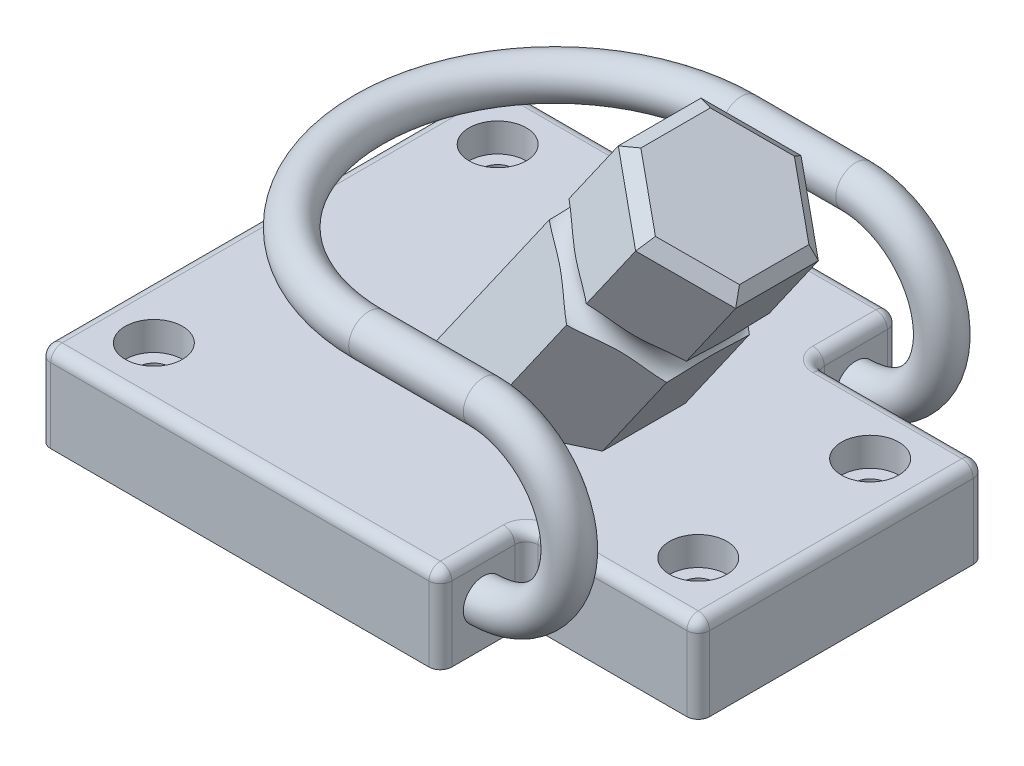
from build123d import *

# Parameters (mm, degrees)
BOSS_EXTRUDE1_DEPTH            = 15
BOSS_EXTRUDE3_DEPTH            = 60
SKETCH6_R                      = 3
CHAMFER1_SIZE                  = 2
SKETCH10_R                     = 3.5
REVOLVE1_ANGLE                 = 180
SKETCH12_R                     = 3.5
BOSS_EXTRUDE4_DEPTH            = 20
SKETCH13_R                     = 3.5
REVOLVE2_ANGLE                 = 180
FILLET2_R                      = 2
FILLET3_R                      = 2
CBORE_FOR_M5_SHCS1_D           = 5.5
CBORE_FOR_M5_SHCS1_CBORE_D     = 10
CBORE_FOR_M5_SHCS1_CBORE_DEPTH = 5


with BuildPart() as part:
    # Sketch1 → Boss-Extrude1 (new body)
    with BuildSketch(Plane(origin=(0, 0, 0), x_dir=(1, 0, 0), z_dir=(0, 1, 0))):
        Polygon((35, 25), (35, 40), (-35, 40), (-35, -40), (35, -40), (35, -25), (65, -25), (65, 25), align=None)
    extrude(amount=BOSS_EXTRUDE1_DEPTH)

    # Sketch5 → Boss-Extrude3 (add)
    with BuildSketch(Plane(origin=(7.047694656, 10.065151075, 0), x_dir=(0, 0, 1), z_dir=(0.5735764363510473, 0.819152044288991, 0))):
        Polygon((7.216878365, -8.603646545), (14.43375673, 3.896353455), (7.216878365, 16.396353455), (-7.216878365, 16.396353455), (-14.43375673, 3.896353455), (-7.216878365, -8.603646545), align=None)
    extrude(amount=BOSS_EXTRUDE3_DEPTH)

    # Sketch6 → Cut-Revolve1 (revolve, cut)
    with BuildSketch(Plane.XY, mode=Mode.PRIVATE) as cut_revolve1_sk:
        with Locations((21.304753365, 48.913234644)):
            Circle(SKETCH6_R)
    revolve(cut_revolve1_sk.sketch.rotate(Axis((35.331345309, 43.665305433, 0), (0.5735764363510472, 0.819152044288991, 0)), 209.999999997), axis=Axis((35.331345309, 43.665305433, 0), (0.5735764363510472, 0.819152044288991, 0)), mode=Mode.SUBTRACT)

    # Chamfer1
    chamfer1_edges = [part.edges().sort_by_distance(p)[0] for p in [
        (34.414586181, 64.149122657, 0),
        (39.534286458, 60.56426993, 10.825317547),
        (49.773687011, 53.394564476, 10.825317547),
        (54.893387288, 49.809711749, 0),
        (49.773687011, 53.394564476, -10.825317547),
        (39.534286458, 60.56426993, -10.825317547),
    ]]
    chamfer(chamfer1_edges, length=CHAMFER1_SIZE)

    # Sketch10 → Revolve1 (revolve)
    with BuildSketch(Plane(origin=(35, 0, 0), x_dir=(0, 0, -1), z_dir=(1, 0, 0))):
        with Locations((-32.5, 7.5)):
            Circle(SKETCH10_R)
    revolve1 = revolve(axis=Axis((35, 22.5, 45.120164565), (0, 0, 1)), revolution_arc=REVOLVE1_ANGLE)

    # Sketch12 → Boss-Extrude4 (add)
    with BuildSketch(Plane.ZY.offset(-35)):
        with Locations(Location((32.5, 37.5, 0), (0, 0, 90))):
            Circle(SKETCH12_R)
    boss_extrude4 = extrude(amount=BOSS_EXTRUDE4_DEPTH)

    # Mirror2: Revolve1, Boss-Extrude4 across plane
    add(revolve1.mirror(Plane.XY))
    add(boss_extrude4.mirror(Plane.XY))

    # Sketch13 → Revolve2 (revolve)
    with BuildSketch(Plane.ZY.offset(-15)):
        with Locations(Location((-32.5, 37.5, 0), (0, 0, 90))):
            Circle(SKETCH13_R)
    revolve(axis=Axis((15, 25.687630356, 0), (0, 1, 0)), revolution_arc=REVOLVE2_ANGLE)

    # Fillet2
    fillet2_edges = [part.edges().sort_by_distance(p)[0] for p in [
        (35, 7.5, -40),
        (35, 7.5, -25),
        (65, 7.5, -25),
        (65, 7.5, 25),
        (35, 7.5, 25),
        (35, 7.5, 40),
        (-35, 7.5, 40),
        (-35, 7.5, -40),
    ]]
    fillet(fillet2_edges, radius=FILLET2_R)

    # Fillet3
    fillet3_edges = [part.edges().sort_by_distance(p)[0] for p in [
        (65, 15, 0),
        (50, 15, 25),
        (0, 15, -40),
        (-35, 15, 0),
        (0, 15, 40),
        (35, 15, 32.5),
        (50, 15, -25),
        (35, 15, -32.5),
        (34.414213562, 15, -39.414213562),
        (-34.414213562, 15, -39.414213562),
        (-34.414213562, 15, 39.414213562),
        (34.414213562, 15, 39.414213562),
        (64.414213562, 15, -24.414213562),
        (64.414213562, 15, 24.414213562),
        (35.585786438, 15, 25.585786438),
        (35.585786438, 15, -25.585786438),
    ]]
    fillet(fillet3_edges, radius=FILLET3_R)

    # CBORE for M5 SHCS1 (through all)
    with Locations(Plane(origin=(0, 15, 0), x_dir=(1, 0, 0), z_dir=(0, 1, 0))):
        with Locations((-25, 30), (55, 15)):
            cbore_for_m5_shcs1 = CounterBoreHole(CBORE_FOR_M5_SHCS1_D / 2, CBORE_FOR_M5_SHCS1_CBORE_D / 2, CBORE_FOR_M5_SHCS1_CBORE_DEPTH)

    # Mirror3: CBORE for M5 SHCS1 across plane
    add(cbore_for_m5_shcs1.mirror(Plane.XY), mode=Mode.SUBTRACT)


solid = part.part
